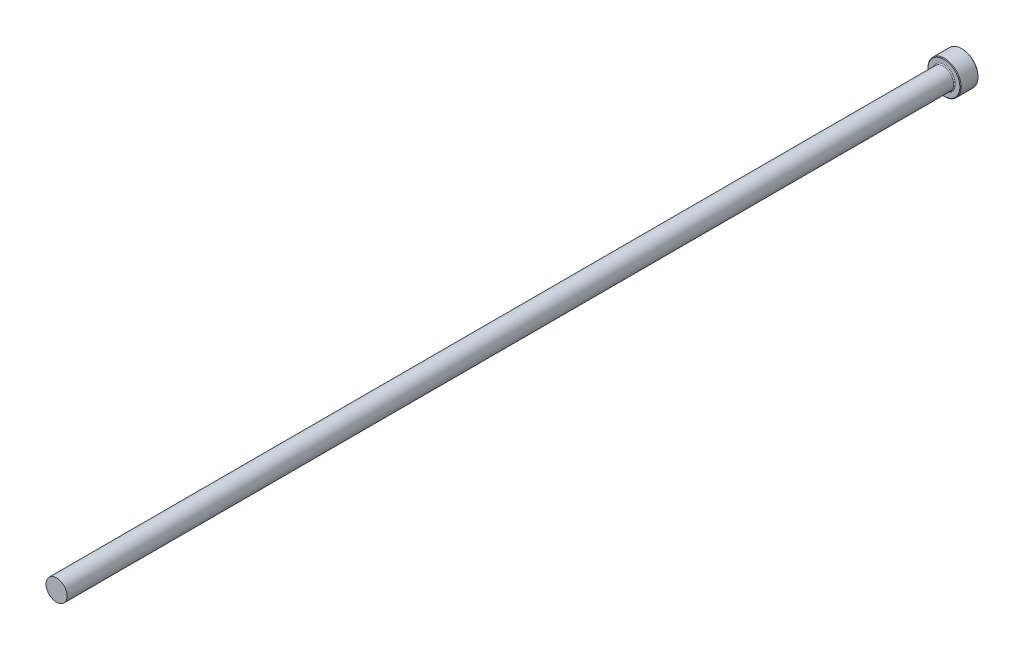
from build123d import *

# Parameters (mm, degrees)
CHAMFER1_SIZE = 0.2


with BuildPart() as part:
    # Sketch1 → Revolve1 (revolve)
    with BuildSketch(Plane(origin=(0, 0, 0), x_dir=(0, 0, -1), z_dir=(1, 0, 0)), mode=Mode.PRIVATE) as revolve1_sk:
        with BuildLine():
            Line((0, 0), (0, 5.5))
            Line((0, 5.5), (-6, 5.5))
            Line((-6, 5.5), (-6, 3.8))
            ThreePointArc((-6, 3.8), (-6.087867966, 3.587867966), (-6.3, 3.5))
            Line((-6.3, 3.5), (-300, 3.5))
            Line((-300, 3.5), (-300, 0))
            Line((-300, 0), (0, 0))
        make_face()
    revolve(revolve1_sk.sketch.rotate(Axis((0, 0, 109.05062828), (0, 0, -1)), 90), axis=Axis((0, 0, 109.05062828), (0, 0, -1)))

    # Chamfer1
    chamfer1_edges = [part.edges().sort_by_distance(p)[0] for p in [
        (-5.5, 0, 0),
        (-5.5, 0, 6),
    ]]
    chamfer(chamfer1_edges, length=CHAMFER1_SIZE)


solid = part.part
